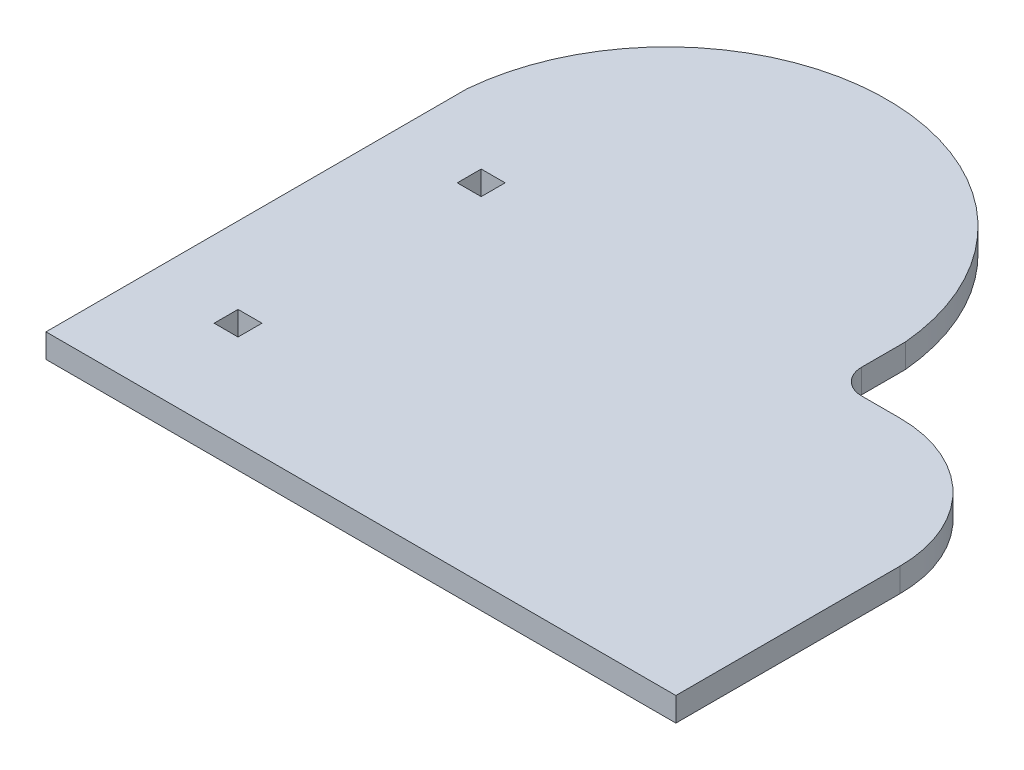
from build123d import *

# Parameters (mm, degrees)
SKETCH2_W         = 83.566
SKETCH2_H         = 1.27
LID_DEPTH         = 3.175
SKETCH3_W         = 3.175
SKETCH3_H         = 3.175
HINGE_SLOTS_DEPTH = 88.803761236


with BuildPart() as part:
    # Sketch2 → lid (new body)
    with BuildSketch(Plane(origin=(0, 0, 0), x_dir=(1, 0, 0), z_dir=(0, 1, 0))):
        with Locations((-34.925, -39.243)):
            Rectangle(SKETCH2_W, SKETCH2_H)
        with BuildLine():
            Line((-76.708, 0), (-76.708, 15.953751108))
            ThreePointArc((-76.708, 15.953751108), (-47.625, 42.606368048), (-18.542, 15.953751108))
            Line((-18.542, 15.953751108), (-18.542, 10.16))
            ThreePointArc((-18.542, 10.16), (-17.574866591, 7.825133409), (-15.24, 6.858))
            Line((-15.24, 6.858), (-10.16, 6.858))
            ThreePointArc((-10.16, 6.858), (1.873543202, 1.873543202), (6.858, -10.16))
            Line((6.858, -10.16), (6.858, -38.608))
            Line((6.858, -38.608), (-76.708, -38.608))
            Line((-76.708, -38.608), (-76.708, 0))
        make_face()
    extrude(amount=LID_DEPTH)

    # Sketch3 → hinge slots (cut, through all)
    with BuildSketch(Plane(origin=(0, 3.175, 0), x_dir=(1, 0, 0), z_dir=(0, 1, 0))):
        with Locations((-64.9605, 6.111251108)):
            Rectangle(SKETCH3_W, SKETCH3_H)
        with Locations((-64.9605, -26.146748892)):
            Rectangle(SKETCH3_W, SKETCH3_H)
    extrude(amount=-HINGE_SLOTS_DEPTH, mode=Mode.SUBTRACT)


solid = part.part
